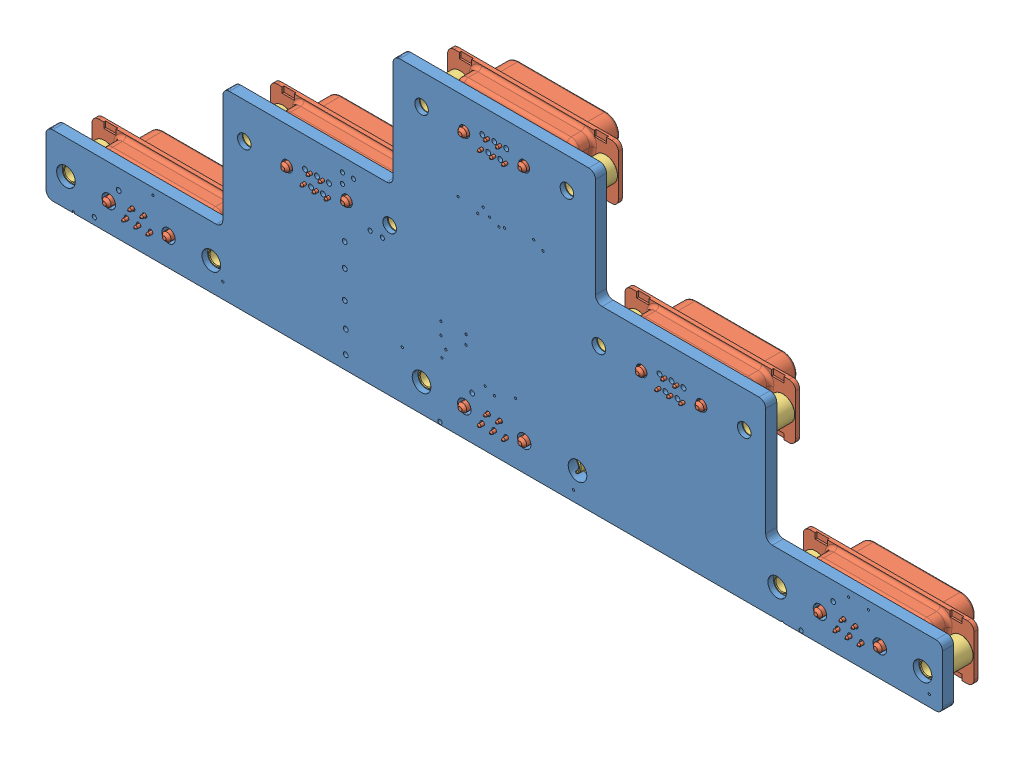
SolidWorks assembly Motherboard, 6 Cell.SLDASM, configuration Default (file format 11000). Lengths in mm.
Overall size (205.54 68.04 31.26).
27 component instances, 5 part files, 23 mates.
Components (placement in the parent):
- Motherboard, 6 Cell-1: Motherboard, 6 Cell.SLDPRT [Default] at origin size (205.54 68.04 2.54)
- CBD7W2 with SMT standoff-1: CBD7W2 with SMT standoff.SLDASM [Default] at (22.606 13.716 -6.35) x (0 1 0) z (-1 0 0) size (12.55 16.86 39.14)
  - CBD7W2M35S6000-1: CBD7W2M35S6000.SLDPRT [without posts] at origin size (12.55 16.86 39.14)
  - 20130118-183809-29217700-1: 20130118-183809-29217700.SLDPRT [Default] at (0 -7.874 16.6624) x (0 1 0) z (0 0 1) size (7.87 5.56 5.56)
  - 20130118-183809-29217700-2: 20130118-183809-29217700.SLDPRT [Default] at (0 -7.874 -16.6624) x (0 1 0) z (0 0 1) size (7.87 5.56 5.56)
- CBD7W2 with SMT standoff-2: CBD7W2 with SMT standoff.SLDASM [Default] at (104.14 13.716 -6.35) x (0 1 0) z (-1 0 0) size (12.55 16.86 39.14)
  - CBD7W2M35S6000-1: CBD7W2M35S6000.SLDPRT [without posts] at origin size (12.55 16.86 39.14)
  - 20130118-183809-29217700-1: 20130118-183809-29217700.SLDPRT [Default] at (0 -7.874 16.6624) x (0 1 0) z (0 0 1) size (7.87 5.56 5.56)
  - 20130118-183809-29217700-2: 20130118-183809-29217700.SLDPRT [Default] at (0 -7.874 -16.6624) x (0 1 0) z (0 0 1) size (7.87 5.56 5.56)
- CBD7W2 with SMT standoff-3: CBD7W2 with SMT standoff.SLDASM [Default] at (185.674 13.716 -6.35) x (0 1 0) z (-1 0 0) size (12.55 16.86 39.14)
  - CBD7W2M35S6000-1: CBD7W2M35S6000.SLDPRT [without posts] at origin size (12.55 16.86 39.14)
  - 20130118-183809-29217700-1: 20130118-183809-29217700.SLDPRT [Default] at (0 -7.874 16.6624) x (0 1 0) z (0 0 1) size (7.87 5.56 5.56)
  - 20130118-183809-29217700-2: 20130118-183809-29217700.SLDPRT [Default] at (0 -7.874 -16.6624) x (0 1 0) z (0 0 1) size (7.87 5.56 5.56)
- CBD7W2 with SMT standoff-4: CBD7W2 with SMT standoff.SLDASM [Default] at (63.5 41.1338 -6.35) x (0 1 0) z (-1 0 0) size (12.55 16.86 39.14)
  - CBD7W2M35S6000-1: CBD7W2M35S6000.SLDPRT [without posts] at origin size (12.55 16.86 39.14)
  - 20130118-183809-29217700-1: 20130118-183809-29217700.SLDPRT [Default] at (0 -7.874 16.6624) x (0 1 0) z (0 0 1) size (7.87 5.56 5.56)
  - 20130118-183809-29217700-2: 20130118-183809-29217700.SLDPRT [Default] at (0 -7.874 -16.6624) x (0 1 0) z (0 0 1) size (7.87 5.56 5.56)
- CBD7W2 with SMT standoff-5: CBD7W2 with SMT standoff.SLDASM [Default] at (144.78 41.1338 -6.35) x (0 1 0) z (-1 0 0) size (12.55 16.86 39.14)
  - CBD7W2M35S6000-1: CBD7W2M35S6000.SLDPRT [without posts] at origin size (12.55 16.86 39.14)
  - 20130118-183809-29217700-1: 20130118-183809-29217700.SLDPRT [Default] at (0 -7.874 16.6624) x (0 1 0) z (0 0 1) size (7.87 5.56 5.56)
  - 20130118-183809-29217700-2: 20130118-183809-29217700.SLDPRT [Default] at (0 -7.874 -16.6624) x (0 1 0) z (0 0 1) size (7.87 5.56 5.56)
- CBD7W2 with SMT standoff-6: CBD7W2 with SMT standoff.SLDASM [Default] at (104.14 68.3118 -6.35) x (0 1 0) z (-1 0 0) size (12.55 16.86 39.14)
  - CBD7W2M35S6000-1: CBD7W2M35S6000.SLDPRT [without posts] at origin size (12.55 16.86 39.14)
  - 20130118-183809-29217700-1: 20130118-183809-29217700.SLDPRT [Default] at (0 -7.874 16.6624) x (0 1 0) z (0 0 1) size (7.87 5.56 5.56)
  - 20130118-183809-29217700-2: 20130118-183809-29217700.SLDPRT [Default] at (0 -7.874 -16.6624) x (0 1 0) z (0 0 1) size (7.87 5.56 5.56)
- PLB10W2F4B3N0A1-1: PLB10W2F4B3N0A1.SLDPRT [Default] at (112.7066 41.5784 2.54) x (0 1 0) z (1 0 0) size (43.64 19.1 27.36)
- PLB10W2M0000-1: PLB10W2M0000.SLDPRT [Default] at (139.9608 41.5784 10.2362) x (0 1 0) z (1 0 0) size (40.08 15.39 27.25)
Mates (geometry in assembly coordinates):
- Concentric1: concentric: cylinder of Motherboard, 6 Cell-1 through (5.9436 13.716 2.54) axis (0 0 -1) radius 2.1463; cylinder of CBD7W2 with SMT standoff-1/20130118-183809-29217700-1 through (5.9436 13.716 1.3195) axis (0 0 -1) radius 2.0447
- Concentric2: concentric: cylinder of Motherboard, 6 Cell-1 through (39.2684 13.716 2.54) axis (0 0 -1) radius 2.1463; cylinder of CBD7W2 with SMT standoff-1/20130118-183809-29217700-2 through (39.2684 13.716 1.3195) axis (0 0 -1) radius 2.0447
- Coincident1: coincident: plane of Motherboard, 6 Cell-1 through (0 0 0) normal (0 0 -1); plane of CBD7W2 with SMT standoff-1/20130118-183809-29217700-2 through (41.9663 16.4678 0) normal (0 0 1)
- Concentric3: concentric: cylinder of Motherboard, 6 Cell-1 through (87.4776 13.716 2.54) axis (0 0 -1) radius 2.1463; cylinder of CBD7W2 with SMT standoff-2/20130118-183809-29217700-1 through (87.4776 13.716 1.3195) axis (0 0 -1) radius 2.0447
- Concentric5: concentric: cylinder of Motherboard, 6 Cell-1 through (110.998 13.716 2.54) axis (0 0 -1) radius 1.5494; cylinder of CBD7W2 with SMT standoff-2/CBD7W2M35S6000-1 through (110.998 13.716 3.5306) axis (0 0 -1) radius 0.9906
- Coincident2: coincident: plane of Motherboard, 6 Cell-1 through (0 0 0) normal (0 0 -1); plane of CBD7W2 with SMT standoff-2/20130118-183809-29217700-1 through (90.1755 16.4678 0) normal (0 0 1)
- Concentric6: concentric: cylinder of Motherboard, 6 Cell-1 through (169.0116 13.716 2.54) axis (0 0 -1) radius 2.1463; cylinder of CBD7W2 with SMT standoff-3/20130118-183809-29217700-1 through (169.0116 13.716 1.3195) axis (0 0 -1) radius 2.0447
- Concentric7: concentric: cylinder of Motherboard, 6 Cell-1 through (202.3364 13.716 2.54) axis (0 0 -1) radius 2.1463; cylinder of CBD7W2 with SMT standoff-3/20130118-183809-29217700-2 through (202.3364 13.716 1.3195) axis (0 0 -1) radius 2.0447
- Coincident3: coincident: plane of Motherboard, 6 Cell-1 through (0 0 0) normal (0 0 -1); plane of CBD7W2 with SMT standoff-3/20130118-183809-29217700-2 through (205.0343 16.4678 0) normal (0 0 1)
- Concentric8: concentric: cylinder of Motherboard, 6 Cell-1 through (46.8376 41.1338 2.54) axis (0 0 -1) radius 1.5621; cylinder of CBD7W2 with SMT standoff-4/20130118-183809-29217700-1 through (46.8376 41.1338 1.3195) axis (0 0 -1) radius 2.0447
- Concentric10: concentric: cylinder of Motherboard, 6 Cell-1 through (80.1624 41.1338 2.54) axis (0 0 -1) radius 1.5621; cylinder of CBD7W2 with SMT standoff-4/20130118-183809-29217700-2 through (80.1624 41.1338 1.3195) axis (0 0 -1) radius 2.0447
- Coincident4: coincident: plane of Motherboard, 6 Cell-1 through (0 0 0) normal (0 0 -1); plane of CBD7W2 with SMT standoff-4/20130118-183809-29217700-1 through (49.5355 43.8857 0) normal (0 0 1)
- Concentric11: concentric: cylinder of Motherboard, 6 Cell-1 through (128.1176 41.1338 2.54) axis (0 0 -1) radius 1.5621; cylinder of CBD7W2 with SMT standoff-5/20130118-183809-29217700-1 through (128.1176 41.1338 1.3195) axis (0 0 -1) radius 2.0447
- Concentric12: concentric: cylinder of Motherboard, 6 Cell-1 through (161.4424 41.1338 2.54) axis (0 0 -1) radius 1.5621; circle of CBD7W2 with SMT standoff-5/20130118-183809-29217700-2
- Coincident5: coincident: plane of Motherboard, 6 Cell-1 through (0 0 0) normal (0 0 -1); plane of CBD7W2 with SMT standoff-5/20130118-183809-29217700-2 through (164.1403 43.8857 0) normal (0 0 1)
- Concentric13: concentric: cylinder of Motherboard, 6 Cell-1 through (87.4776 68.3118 2.54) axis (0 0 -1) radius 1.5621; cylinder of CBD7W2 with SMT standoff-6/20130118-183809-29217700-1 through (87.4776 68.3118 1.3195) axis (0 0 -1) radius 2.0447
- Concentric14: concentric: cylinder of Motherboard, 6 Cell-1 through (120.8024 68.3118 2.54) axis (0 0 -1) radius 1.5621; cylinder of CBD7W2 with SMT standoff-6/20130118-183809-29217700-2 through (120.8024 68.3118 1.3195) axis (0 0 -1) radius 2.0447
- Coincident6: coincident: plane of Motherboard, 6 Cell-1 through (0 0 0) normal (0 0 -1); plane of CBD7W2 with SMT standoff-6/20130118-183809-29217700-2 through (123.5003 71.0637 0) normal (0 0 1)
- Coincident7: coincident: plane of Motherboard, 6 Cell-1 through (0 0 2.54) normal (0 0 1); plane of PLB10W2F4B3N0A1-1 through (106.6106 19.7598 2.54) normal (0 0 -1)
- Parallel1: parallel: plane of Motherboard, 6 Cell-1 through (1.3716 7.3203 2.54) normal (0 -1 0); plane of PLB10W2F4B3N0A1-1 through (107.8806 19.7598 2.54) normal (0 -1 0)
- Coincident10: coincident: plane of PLB10W2F4B3N0A1-1 through (112.7066 19.7598 17.9324) normal (1 0 0); plane of PLB10W2M0000-1 through (112.7066 25.8812 17.9324) normal (-1 0 0)
- Concentric16: concentric: cylinder of PLB10W2F4B3N0A1-1 through (119.1328 30.377 10.2362) axis (1 0 0) radius 2.6289; cylinder of PLB10W2M0000-1 through (123.3746 30.377 10.2362) axis (-1 0 0) radius 2.6416
- Concentric17: concentric: cylinder of PLB10W2F4B3N0A1-1 through (119.1328 52.7798 10.2362) axis (1 0 0) radius 2.6289; cylinder of PLB10W2M0000-1 through (123.3746 52.7798 10.2362) axis (-1 0 0) radius 2.6416
